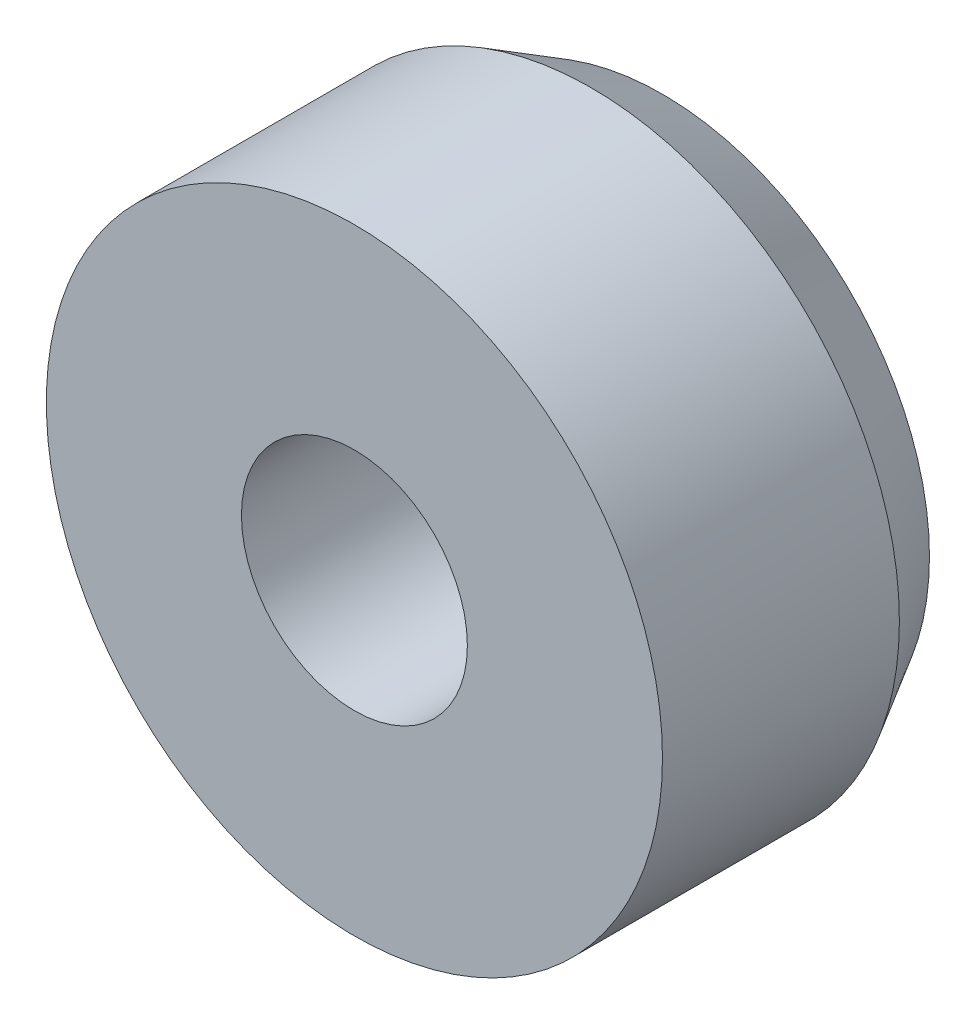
from build123d import *

# Parameters (mm, degrees)
ESQUISSE1_R             = 15
ESQUISSE1_R_2           = 5.5
BASE_EXTRUSION_DEPTH    = 15
ESQUISSE2_R             = 8.5
ENL_V_MAT_EXTRU_1_DEPTH = 4
CHANFREIN1_SIZE         = 3.464101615
CHANFREIN1_SIZE2        = 2


with BuildPart() as part:
    # Esquisse1 → Base-Extrusion (new body)
    with BuildSketch(Plane.XY):
        Circle(ESQUISSE1_R)
        Circle(ESQUISSE1_R_2, mode=Mode.SUBTRACT)
    extrude(amount=BASE_EXTRUSION_DEPTH)

    # Esquisse2 → Enl_v. mat.-Extru.1 (cut)
    with BuildSketch(Plane(origin=(0, 0, 0), x_dir=(-1, 0, 0), z_dir=(0, 0, -1))):
        Circle(ESQUISSE2_R)
    extrude(amount=-ENL_V_MAT_EXTRU_1_DEPTH, mode=Mode.SUBTRACT)

    # Chanfrein1
    chanfrein1_edges = [part.edges().sort_by_distance(p)[0] for p in [
        (-15, 0, 0),
    ]]
    chanfrein1_side = [part.faces().sort_by_distance(p)[0] for p in [
        (-15, 0, 7.5),
    ]]
    chamfer(chanfrein1_edges, length=CHANFREIN1_SIZE, length2=CHANFREIN1_SIZE2, reference=chanfrein1_side[0])


solid = part.part
